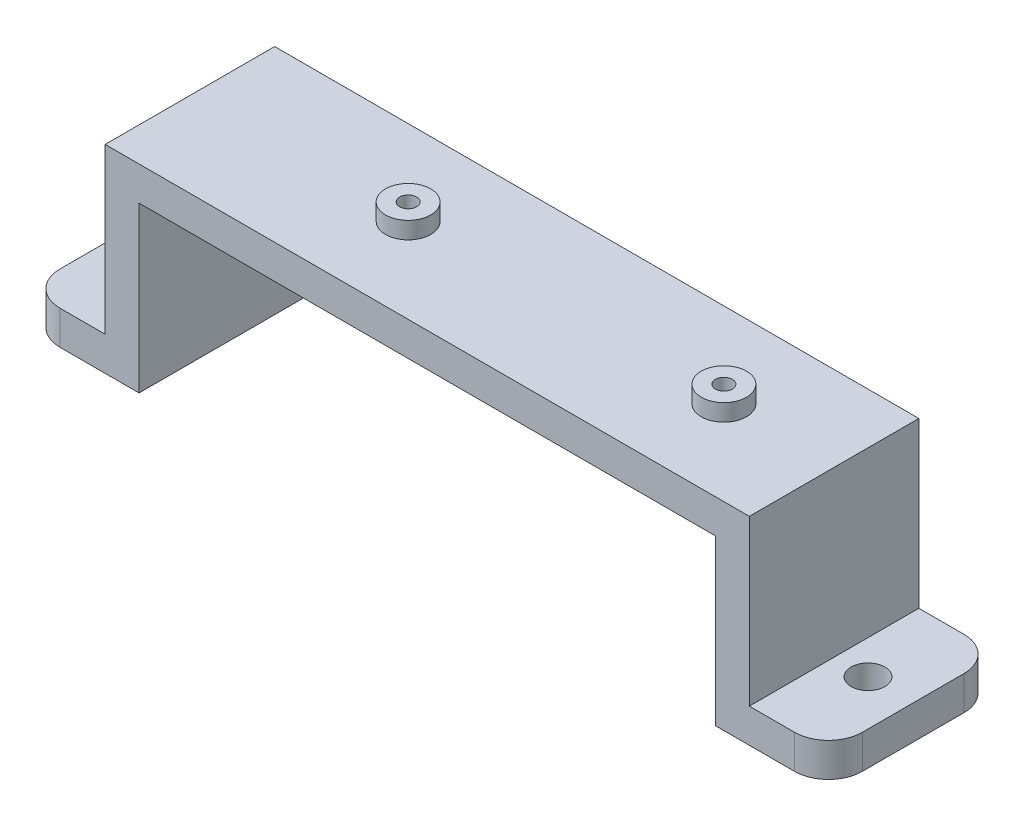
ISO-10303-21;
HEADER;
FILE_DESCRIPTION(('STEP AP214'),'2;1');
FILE_NAME('part.step','',(''),(''),'','','');
FILE_SCHEMA(('AUTOMOTIVE_DESIGN { 1 0 10303 214 1 1 1 1 }'));
ENDSEC;
DATA;
#1=APPLICATION_CONTEXT('core data for automotive mechanical design processes');
#2=APPLICATION_PROTOCOL_DEFINITION('international standard','automotive_design',2000,#1);
#3=PRODUCT_CONTEXT('',#1,'mechanical');
#4=PRODUCT('Part','Part','',(#3));
#5=PRODUCT_RELATED_PRODUCT_CATEGORY('part','',(#4));
#6=PRODUCT_DEFINITION_FORMATION('','',#4);
#7=PRODUCT_DEFINITION_CONTEXT('part definition',#1,'design');
#8=PRODUCT_DEFINITION('design','',#6,#7);
#9=PRODUCT_DEFINITION_SHAPE('','',#8);
#10=(LENGTH_UNIT() NAMED_UNIT(*) SI_UNIT(.MILLI.,.METRE.));
#11=(NAMED_UNIT(*) PLANE_ANGLE_UNIT() SI_UNIT($,.RADIAN.));
#12=(NAMED_UNIT(*) SI_UNIT($,.STERADIAN.) SOLID_ANGLE_UNIT());
#13=UNCERTAINTY_MEASURE_WITH_UNIT(LENGTH_MEASURE(1.E-05),#10,'distance_accuracy_value','');
#14=(GEOMETRIC_REPRESENTATION_CONTEXT(3) GLOBAL_UNCERTAINTY_ASSIGNED_CONTEXT((#13)) GLOBAL_UNIT_ASSIGNED_CONTEXT((#10,
#11,#12)) REPRESENTATION_CONTEXT('',''));
#15=CARTESIAN_POINT('',(0.,0.,0.));
#16=DIRECTION('',(0.,0.,1.));
#17=DIRECTION('',(1.,0.,0.));
#18=AXIS2_PLACEMENT_3D('',#15,#16,#17);
#19=CARTESIAN_POINT('',(-28.5,17.5476177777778,15.));
#20=DIRECTION('',(0.,-1.,0.));
#21=DIRECTION('',(0.,0.,-1.));
#22=AXIS2_PLACEMENT_3D('',#19,#20,#21);
#23=PLANE('',#22);
#24=CARTESIAN_POINT('',(18.75,17.5476177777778,7.5));
#25=DIRECTION('',(0.,-1.,0.));
#26=DIRECTION('',(0.,0.,-1.));
#27=AXIS2_PLACEMENT_3D('',#24,#25,#26);
#28=CIRCLE('',#27,2.);
#29=CARTESIAN_POINT('',(18.75,17.5476177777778,5.5));
#30=VERTEX_POINT('',#29);
#31=EDGE_CURVE('E34',#30,#30,#28,.F.);
#32=ORIENTED_EDGE('',*,*,#31,.F.);
#33=EDGE_LOOP('',(#32));
#34=FACE_BOUND('',#33,.T.);
#35=DIRECTION('',(-1.,0.,0.));
#36=VECTOR('',#35,1.);
#37=CARTESIAN_POINT('',(-28.5,17.5476177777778,0.));
#38=LINE('',#37,#36);
#39=CARTESIAN_POINT('',(28.5,17.5476177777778,0.));
#40=VERTEX_POINT('',#39);
#41=CARTESIAN_POINT('',(-28.5,17.5476177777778,0.));
#42=VERTEX_POINT('',#41);
#43=EDGE_CURVE('E181',#40,#42,#38,.T.);
#44=ORIENTED_EDGE('',*,*,#43,.T.);
#45=DIRECTION('',(0.,0.,-1.));
#46=VECTOR('',#45,1.);
#47=CARTESIAN_POINT('',(-28.5,17.5476177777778,15.));
#48=LINE('',#47,#46);
#49=CARTESIAN_POINT('',(-28.5,17.5476177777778,15.));
#50=VERTEX_POINT('',#49);
#51=EDGE_CURVE('E213',#50,#42,#48,.T.);
#52=ORIENTED_EDGE('',*,*,#51,.F.);
#53=DIRECTION('',(-1.,0.,0.));
#54=VECTOR('',#53,1.);
#55=CARTESIAN_POINT('',(-28.5,17.5476177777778,15.));
#56=LINE('',#55,#54);
#57=CARTESIAN_POINT('',(28.5,17.5476177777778,15.));
#58=VERTEX_POINT('',#57);
#59=EDGE_CURVE('E201',#58,#50,#56,.T.);
#60=ORIENTED_EDGE('',*,*,#59,.F.);
#61=DIRECTION('',(0.,0.,-1.));
#62=VECTOR('',#61,1.);
#63=CARTESIAN_POINT('',(28.5,17.5476177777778,15.));
#64=LINE('',#63,#62);
#65=EDGE_CURVE('E216',#58,#40,#64,.T.);
#66=ORIENTED_EDGE('',*,*,#65,.T.);
#67=EDGE_LOOP('',(#44,#52,#60,#66));
#68=FACE_BOUND('',#67,.T.);
#69=CARTESIAN_POINT('',(-9.19000000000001,17.5476177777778,7.5));
#70=DIRECTION('',(0.,-1.,0.));
#71=DIRECTION('',(0.,0.,-1.));
#72=AXIS2_PLACEMENT_3D('',#69,#70,#71);
#73=CIRCLE('',#72,2.);
#74=CARTESIAN_POINT('',(-9.19000000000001,17.5476177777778,5.5));
#75=VERTEX_POINT('',#74);
#76=EDGE_CURVE('E11',#75,#75,#73,.F.);
#77=ORIENTED_EDGE('',*,*,#76,.F.);
#78=EDGE_LOOP('',(#77));
#79=FACE_BOUND('',#78,.T.);
#80=ADVANCED_FACE('F26',(#34,#68,#79),#23,.F.);
#81=CARTESIAN_POINT('',(-35.5,0.,15.));
#82=DIRECTION('',(1.,0.,0.));
#83=DIRECTION('',(0.,0.,-1.));
#84=AXIS2_PLACEMENT_3D('',#81,#82,#83);
#85=PLANE('',#84);
#86=DIRECTION('',(0.,0.,-1.));
#87=VECTOR('',#86,1.);
#88=CARTESIAN_POINT('',(-35.5,0.,15.));
#89=LINE('',#88,#87);
#90=CARTESIAN_POINT('',(-35.5,0.,12.));
#91=VERTEX_POINT('',#90);
#92=CARTESIAN_POINT('',(-35.5,0.,3.));
#93=VERTEX_POINT('',#92);
#94=EDGE_CURVE('E160',#91,#93,#89,.T.);
#95=ORIENTED_EDGE('',*,*,#94,.F.);
#96=DIRECTION('',(0.,-1.,0.));
#97=VECTOR('',#96,1.);
#98=CARTESIAN_POINT('',(-35.5,0.,12.));
#99=LINE('',#98,#97);
#100=CARTESIAN_POINT('',(-35.5,3.,12.));
#101=VERTEX_POINT('',#100);
#102=EDGE_CURVE('E48',#91,#101,#99,.F.);
#103=ORIENTED_EDGE('',*,*,#102,.T.);
#104=DIRECTION('',(0.,0.,-1.));
#105=VECTOR('',#104,1.);
#106=CARTESIAN_POINT('',(-35.5,3.,15.));
#107=LINE('',#106,#105);
#108=CARTESIAN_POINT('',(-35.5,3.,3.));
#109=VERTEX_POINT('',#108);
#110=EDGE_CURVE('E208',#101,#109,#107,.T.);
#111=ORIENTED_EDGE('',*,*,#110,.T.);
#112=DIRECTION('',(0.,-1.,0.));
#113=VECTOR('',#112,1.);
#114=CARTESIAN_POINT('',(-35.5,0.,3.));
#115=LINE('',#114,#113);
#116=EDGE_CURVE('E262',#109,#93,#115,.T.);
#117=ORIENTED_EDGE('',*,*,#116,.T.);
#118=EDGE_LOOP('',(#95,#103,#111,#117));
#119=FACE_BOUND('',#118,.T.);
#120=ADVANCED_FACE('F28',(#119),#85,.F.);
#121=CARTESIAN_POINT('',(-35.5,0.,15.));
#122=DIRECTION('',(0.,1.,0.));
#123=DIRECTION('',(0.,0.,1.));
#124=AXIS2_PLACEMENT_3D('',#121,#122,#123);
#125=PLANE('',#124);
#126=CARTESIAN_POINT('',(-31.5,0.,7.5));
#127=DIRECTION('',(0.,-1.,0.));
#128=DIRECTION('',(-1.,0.,0.));
#129=AXIS2_PLACEMENT_3D('',#126,#127,#128);
#130=CIRCLE('',#129,1.5);
#131=CARTESIAN_POINT('',(-33.,0.,7.5));
#132=VERTEX_POINT('',#131);
#133=EDGE_CURVE('E276',#132,#132,#130,.T.);
#134=ORIENTED_EDGE('',*,*,#133,.F.);
#135=EDGE_LOOP('',(#134));
#136=FACE_BOUND('',#135,.T.);
#137=DIRECTION('',(1.,0.,0.));
#138=VECTOR('',#137,1.);
#139=CARTESIAN_POINT('',(-35.5,0.,15.));
#140=LINE('',#139,#138);
#141=CARTESIAN_POINT('',(-32.5,0.,15.));
#142=VERTEX_POINT('',#141);
#143=CARTESIAN_POINT('',(-25.5,0.,15.));
#144=VERTEX_POINT('',#143);
#145=EDGE_CURVE('E187',#142,#144,#140,.T.);
#146=ORIENTED_EDGE('',*,*,#145,.F.);
#147=CARTESIAN_POINT('',(-32.5,0.,12.));
#148=DIRECTION('',(0.,1.,0.));
#149=DIRECTION('',(0.,0.,1.));
#150=AXIS2_PLACEMENT_3D('',#147,#148,#149);
#151=CIRCLE('',#150,3.);
#152=EDGE_CURVE('E260',#142,#91,#151,.F.);
#153=ORIENTED_EDGE('',*,*,#152,.T.);
#154=ORIENTED_EDGE('',*,*,#94,.T.);
#155=CARTESIAN_POINT('',(-32.5,0.,3.));
#156=DIRECTION('',(0.,1.,0.));
#157=DIRECTION('',(0.,0.,1.));
#158=AXIS2_PLACEMENT_3D('',#155,#156,#157);
#159=CIRCLE('',#158,3.);
#160=CARTESIAN_POINT('',(-32.5,0.,0.));
#161=VERTEX_POINT('',#160);
#162=EDGE_CURVE('E148',#93,#161,#159,.F.);
#163=ORIENTED_EDGE('',*,*,#162,.T.);
#164=DIRECTION('',(1.,0.,0.));
#165=VECTOR('',#164,1.);
#166=CARTESIAN_POINT('',(-35.5,0.,0.));
#167=LINE('',#166,#165);
#168=CARTESIAN_POINT('',(-25.5,0.,0.));
#169=VERTEX_POINT('',#168);
#170=EDGE_CURVE('E141',#161,#169,#167,.T.);
#171=ORIENTED_EDGE('',*,*,#170,.T.);
#172=DIRECTION('',(0.,0.,-1.));
#173=VECTOR('',#172,1.);
#174=CARTESIAN_POINT('',(-25.5,0.,15.));
#175=LINE('',#174,#173);
#176=EDGE_CURVE('E145',#144,#169,#175,.T.);
#177=ORIENTED_EDGE('',*,*,#176,.F.);
#178=EDGE_LOOP('',(#146,#153,#154,#163,#171,#177));
#179=FACE_BOUND('',#178,.T.);
#180=ADVANCED_FACE('F144',(#136,#179),#125,.F.);
#181=CARTESIAN_POINT('',(-25.5,0.,15.));
#182=DIRECTION('',(-1.,0.,0.));
#183=DIRECTION('',(0.,0.,1.));
#184=AXIS2_PLACEMENT_3D('',#181,#182,#183);
#185=PLANE('',#184);
#186=DIRECTION('',(0.,1.,0.));
#187=VECTOR('',#186,1.);
#188=CARTESIAN_POINT('',(-25.5,0.,0.));
#189=LINE('',#188,#187);
#190=CARTESIAN_POINT('',(-25.5,14.5476177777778,0.));
#191=VERTEX_POINT('',#190);
#192=EDGE_CURVE('E152',#169,#191,#189,.T.);
#193=ORIENTED_EDGE('',*,*,#192,.T.);
#194=DIRECTION('',(0.,0.,-1.));
#195=VECTOR('',#194,1.);
#196=CARTESIAN_POINT('',(-25.5,14.5476177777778,15.));
#197=LINE('',#196,#195);
#198=CARTESIAN_POINT('',(-25.5,14.5476177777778,15.));
#199=VERTEX_POINT('',#198);
#200=EDGE_CURVE('E161',#199,#191,#197,.T.);
#201=ORIENTED_EDGE('',*,*,#200,.F.);
#202=DIRECTION('',(0.,1.,0.));
#203=VECTOR('',#202,1.);
#204=CARTESIAN_POINT('',(-25.5,0.,15.));
#205=LINE('',#204,#203);
#206=EDGE_CURVE('E159',#144,#199,#205,.T.);
#207=ORIENTED_EDGE('',*,*,#206,.F.);
#208=ORIENTED_EDGE('',*,*,#176,.T.);
#209=EDGE_LOOP('',(#193,#201,#207,#208));
#210=FACE_BOUND('',#209,.T.);
#211=ADVANCED_FACE('F156',(#210),#185,.F.);
#212=CARTESIAN_POINT('',(-25.5,14.5476177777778,15.));
#213=DIRECTION('',(0.,1.,0.));
#214=DIRECTION('',(-1.,0.,0.));
#215=AXIS2_PLACEMENT_3D('',#212,#213,#214);
#216=PLANE('',#215);
#217=CARTESIAN_POINT('',(18.75,14.5476177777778,7.5));
#218=DIRECTION('',(0.,1.,0.));
#219=DIRECTION('',(-1.,0.,0.));
#220=AXIS2_PLACEMENT_3D('',#217,#218,#219);
#221=CIRCLE('',#220,0.750000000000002);
#222=CARTESIAN_POINT('',(18.75,14.5476177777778,8.25));
#223=VERTEX_POINT('',#222);
#224=EDGE_CURVE('E272',#223,#223,#221,.T.);
#225=ORIENTED_EDGE('',*,*,#224,.T.);
#226=EDGE_LOOP('',(#225));
#227=FACE_BOUND('',#226,.T.);
#228=CARTESIAN_POINT('',(-9.19000000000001,14.5476177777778,7.5));
#229=DIRECTION('',(0.,1.,0.));
#230=DIRECTION('',(-1.,0.,0.));
#231=AXIS2_PLACEMENT_3D('',#228,#229,#230);
#232=CIRCLE('',#231,0.75);
#233=CARTESIAN_POINT('',(-9.19000000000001,14.5476177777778,8.25));
#234=VERTEX_POINT('',#233);
#235=EDGE_CURVE('E153',#234,#234,#232,.T.);
#236=ORIENTED_EDGE('',*,*,#235,.T.);
#237=EDGE_LOOP('',(#236));
#238=FACE_BOUND('',#237,.T.);
#239=DIRECTION('',(1.,0.,0.));
#240=VECTOR('',#239,1.);
#241=CARTESIAN_POINT('',(-25.5,14.5476177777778,0.));
#242=LINE('',#241,#240);
#243=CARTESIAN_POINT('',(25.5,14.5476177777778,0.));
#244=VERTEX_POINT('',#243);
#245=EDGE_CURVE('E167',#191,#244,#242,.T.);
#246=ORIENTED_EDGE('',*,*,#245,.T.);
#247=DIRECTION('',(0.,0.,-1.));
#248=VECTOR('',#247,1.);
#249=CARTESIAN_POINT('',(25.5,14.5476177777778,15.));
#250=LINE('',#249,#248);
#251=CARTESIAN_POINT('',(25.5,14.5476177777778,15.));
#252=VERTEX_POINT('',#251);
#253=EDGE_CURVE('E231',#252,#244,#250,.T.);
#254=ORIENTED_EDGE('',*,*,#253,.F.);
#255=DIRECTION('',(1.,0.,0.));
#256=VECTOR('',#255,1.);
#257=CARTESIAN_POINT('',(-25.5,14.5476177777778,15.));
#258=LINE('',#257,#256);
#259=EDGE_CURVE('E190',#199,#252,#258,.T.);
#260=ORIENTED_EDGE('',*,*,#259,.F.);
#261=ORIENTED_EDGE('',*,*,#200,.T.);
#262=EDGE_LOOP('',(#246,#254,#260,#261));
#263=FACE_BOUND('',#262,.T.);
#264=ADVANCED_FACE('F374',(#227,#238,#263),#216,.F.);
#265=CARTESIAN_POINT('',(25.5,14.5476177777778,15.));
#266=DIRECTION('',(1.,0.,0.));
#267=DIRECTION('',(0.,1.,0.));
#268=AXIS2_PLACEMENT_3D('',#265,#266,#267);
#269=PLANE('',#268);
#270=DIRECTION('',(0.,-1.,0.));
#271=VECTOR('',#270,1.);
#272=CARTESIAN_POINT('',(25.5,14.5476177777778,0.));
#273=LINE('',#272,#271);
#274=CARTESIAN_POINT('',(25.5,0.,0.));
#275=VERTEX_POINT('',#274);
#276=EDGE_CURVE('E169',#244,#275,#273,.T.);
#277=ORIENTED_EDGE('',*,*,#276,.T.);
#278=DIRECTION('',(0.,0.,-1.));
#279=VECTOR('',#278,1.);
#280=CARTESIAN_POINT('',(25.5,0.,15.));
#281=LINE('',#280,#279);
#282=CARTESIAN_POINT('',(25.5,0.,15.));
#283=VERTEX_POINT('',#282);
#284=EDGE_CURVE('E228',#283,#275,#281,.T.);
#285=ORIENTED_EDGE('',*,*,#284,.F.);
#286=DIRECTION('',(0.,-1.,0.));
#287=VECTOR('',#286,1.);
#288=CARTESIAN_POINT('',(25.5,14.5476177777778,15.));
#289=LINE('',#288,#287);
#290=EDGE_CURVE('E192',#252,#283,#289,.T.);
#291=ORIENTED_EDGE('',*,*,#290,.F.);
#292=ORIENTED_EDGE('',*,*,#253,.T.);
#293=EDGE_LOOP('',(#277,#285,#291,#292));
#294=FACE_BOUND('',#293,.T.);
#295=ADVANCED_FACE('F370',(#294),#269,.F.);
#296=CARTESIAN_POINT('',(25.5,0.,15.));
#297=DIRECTION('',(0.,1.,0.));
#298=DIRECTION('',(-1.,0.,0.));
#299=AXIS2_PLACEMENT_3D('',#296,#297,#298);
#300=PLANE('',#299);
#301=CARTESIAN_POINT('',(31.5,0.,7.5));
#302=DIRECTION('',(0.,-1.,0.));
#303=DIRECTION('',(1.,0.,0.));
#304=AXIS2_PLACEMENT_3D('',#301,#302,#303);
#305=CIRCLE('',#304,1.5);
#306=CARTESIAN_POINT('',(33.,0.,7.5));
#307=VERTEX_POINT('',#306);
#308=EDGE_CURVE('E273',#307,#307,#305,.T.);
#309=ORIENTED_EDGE('',*,*,#308,.F.);
#310=EDGE_LOOP('',(#309));
#311=FACE_BOUND('',#310,.T.);
#312=DIRECTION('',(0.,0.,-1.));
#313=VECTOR('',#312,1.);
#314=CARTESIAN_POINT('',(35.5,0.,15.));
#315=LINE('',#314,#313);
#316=CARTESIAN_POINT('',(35.5,0.,12.));
#317=VERTEX_POINT('',#316);
#318=CARTESIAN_POINT('',(35.5,0.,3.));
#319=VERTEX_POINT('',#318);
#320=EDGE_CURVE('E225',#317,#319,#315,.T.);
#321=ORIENTED_EDGE('',*,*,#320,.F.);
#322=CARTESIAN_POINT('',(32.5,0.,12.));
#323=DIRECTION('',(0.,1.,0.));
#324=DIRECTION('',(-1.,0.,0.));
#325=AXIS2_PLACEMENT_3D('',#322,#323,#324);
#326=CIRCLE('',#325,3.);
#327=CARTESIAN_POINT('',(32.5,0.,15.));
#328=VERTEX_POINT('',#327);
#329=EDGE_CURVE('E253',#317,#328,#326,.F.);
#330=ORIENTED_EDGE('',*,*,#329,.T.);
#331=DIRECTION('',(1.,0.,0.));
#332=VECTOR('',#331,1.);
#333=CARTESIAN_POINT('',(25.5,0.,15.));
#334=LINE('',#333,#332);
#335=EDGE_CURVE('E194',#283,#328,#334,.T.);
#336=ORIENTED_EDGE('',*,*,#335,.F.);
#337=ORIENTED_EDGE('',*,*,#284,.T.);
#338=DIRECTION('',(1.,0.,0.));
#339=VECTOR('',#338,1.);
#340=CARTESIAN_POINT('',(25.5,0.,0.));
#341=LINE('',#340,#339);
#342=CARTESIAN_POINT('',(32.5,0.,0.));
#343=VERTEX_POINT('',#342);
#344=EDGE_CURVE('E174',#275,#343,#341,.T.);
#345=ORIENTED_EDGE('',*,*,#344,.T.);
#346=CARTESIAN_POINT('',(32.5,0.,3.));
#347=DIRECTION('',(0.,1.,0.));
#348=DIRECTION('',(-1.,0.,0.));
#349=AXIS2_PLACEMENT_3D('',#346,#347,#348);
#350=CIRCLE('',#349,3.);
#351=EDGE_CURVE('E251',#343,#319,#350,.F.);
#352=ORIENTED_EDGE('',*,*,#351,.T.);
#353=EDGE_LOOP('',(#321,#330,#336,#337,#345,#352));
#354=FACE_BOUND('',#353,.T.);
#355=ADVANCED_FACE('F366',(#311,#354),#300,.F.);
#356=CARTESIAN_POINT('',(35.5,3.,15.));
#357=DIRECTION('',(-1.,0.,0.));
#358=DIRECTION('',(0.,0.,1.));
#359=AXIS2_PLACEMENT_3D('',#356,#357,#358);
#360=PLANE('',#359);
#361=DIRECTION('',(0.,0.,-1.));
#362=VECTOR('',#361,1.);
#363=CARTESIAN_POINT('',(35.5,3.,15.));
#364=LINE('',#363,#362);
#365=CARTESIAN_POINT('',(35.5,3.,12.));
#366=VERTEX_POINT('',#365);
#367=CARTESIAN_POINT('',(35.5,3.,3.));
#368=VERTEX_POINT('',#367);
#369=EDGE_CURVE('E222',#366,#368,#364,.T.);
#370=ORIENTED_EDGE('',*,*,#369,.F.);
#371=DIRECTION('',(0.,1.,0.));
#372=VECTOR('',#371,1.);
#373=CARTESIAN_POINT('',(35.5,3.,12.));
#374=LINE('',#373,#372);
#375=EDGE_CURVE('E249',#366,#317,#374,.F.);
#376=ORIENTED_EDGE('',*,*,#375,.T.);
#377=ORIENTED_EDGE('',*,*,#320,.T.);
#378=DIRECTION('',(0.,1.,0.));
#379=VECTOR('',#378,1.);
#380=CARTESIAN_POINT('',(35.5,3.,3.));
#381=LINE('',#380,#379);
#382=EDGE_CURVE('E246',#319,#368,#381,.T.);
#383=ORIENTED_EDGE('',*,*,#382,.T.);
#384=EDGE_LOOP('',(#370,#376,#377,#383));
#385=FACE_BOUND('',#384,.T.);
#386=ADVANCED_FACE('F362',(#385),#360,.F.);
#387=CARTESIAN_POINT('',(28.5,3.,15.));
#388=DIRECTION('',(0.,-1.,0.));
#389=DIRECTION('',(0.,0.,-1.));
#390=AXIS2_PLACEMENT_3D('',#387,#388,#389);
#391=PLANE('',#390);
#392=CARTESIAN_POINT('',(31.5,3.,7.5));
#393=DIRECTION('',(0.,-1.,0.));
#394=DIRECTION('',(0.,0.,-1.));
#395=AXIS2_PLACEMENT_3D('',#392,#393,#394);
#396=CIRCLE('',#395,1.5);
#397=CARTESIAN_POINT('',(31.5,3.,5.99999999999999));
#398=VERTEX_POINT('',#397);
#399=EDGE_CURVE('E269',#398,#398,#396,.T.);
#400=ORIENTED_EDGE('',*,*,#399,.T.);
#401=EDGE_LOOP('',(#400));
#402=FACE_BOUND('',#401,.T.);
#403=DIRECTION('',(-1.,0.,0.));
#404=VECTOR('',#403,1.);
#405=CARTESIAN_POINT('',(28.5,3.,15.));
#406=LINE('',#405,#404);
#407=CARTESIAN_POINT('',(32.5,3.,15.));
#408=VERTEX_POINT('',#407);
#409=CARTESIAN_POINT('',(28.5,3.,15.));
#410=VERTEX_POINT('',#409);
#411=EDGE_CURVE('E197',#408,#410,#406,.T.);
#412=ORIENTED_EDGE('',*,*,#411,.F.);
#413=CARTESIAN_POINT('',(32.5,3.,12.));
#414=DIRECTION('',(0.,-1.,0.));
#415=DIRECTION('',(0.,0.,-1.));
#416=AXIS2_PLACEMENT_3D('',#413,#414,#415);
#417=CIRCLE('',#416,3.);
#418=EDGE_CURVE('E244',#408,#366,#417,.F.);
#419=ORIENTED_EDGE('',*,*,#418,.T.);
#420=ORIENTED_EDGE('',*,*,#369,.T.);
#421=CARTESIAN_POINT('',(32.5,3.,3.));
#422=DIRECTION('',(0.,-1.,0.));
#423=DIRECTION('',(0.,0.,-1.));
#424=AXIS2_PLACEMENT_3D('',#421,#422,#423);
#425=CIRCLE('',#424,3.);
#426=CARTESIAN_POINT('',(32.5,3.,0.));
#427=VERTEX_POINT('',#426);
#428=EDGE_CURVE('E242',#368,#427,#425,.F.);
#429=ORIENTED_EDGE('',*,*,#428,.T.);
#430=DIRECTION('',(-1.,0.,0.));
#431=VECTOR('',#430,1.);
#432=CARTESIAN_POINT('',(28.5,3.,0.));
#433=LINE('',#432,#431);
#434=CARTESIAN_POINT('',(28.5,3.,0.));
#435=VERTEX_POINT('',#434);
#436=EDGE_CURVE('E177',#427,#435,#433,.T.);
#437=ORIENTED_EDGE('',*,*,#436,.T.);
#438=DIRECTION('',(0.,0.,-1.));
#439=VECTOR('',#438,1.);
#440=CARTESIAN_POINT('',(28.5,3.,15.));
#441=LINE('',#440,#439);
#442=EDGE_CURVE('E219',#410,#435,#441,.T.);
#443=ORIENTED_EDGE('',*,*,#442,.F.);
#444=EDGE_LOOP('',(#412,#419,#420,#429,#437,#443));
#445=FACE_BOUND('',#444,.T.);
#446=ADVANCED_FACE('F358',(#402,#445),#391,.F.);
#447=CARTESIAN_POINT('',(28.5,17.5476177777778,15.));
#448=DIRECTION('',(-1.,0.,0.));
#449=DIRECTION('',(0.,-1.,0.));
#450=AXIS2_PLACEMENT_3D('',#447,#448,#449);
#451=PLANE('',#450);
#452=DIRECTION('',(0.,1.,0.));
#453=VECTOR('',#452,1.);
#454=CARTESIAN_POINT('',(28.5,17.5476177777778,0.));
#455=LINE('',#454,#453);
#456=EDGE_CURVE('E179',#435,#40,#455,.T.);
#457=ORIENTED_EDGE('',*,*,#456,.T.);
#458=ORIENTED_EDGE('',*,*,#65,.F.);
#459=DIRECTION('',(0.,1.,0.));
#460=VECTOR('',#459,1.);
#461=CARTESIAN_POINT('',(28.5,17.5476177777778,15.));
#462=LINE('',#461,#460);
#463=EDGE_CURVE('E199',#410,#58,#462,.T.);
#464=ORIENTED_EDGE('',*,*,#463,.F.);
#465=ORIENTED_EDGE('',*,*,#442,.T.);
#466=EDGE_LOOP('',(#457,#458,#464,#465));
#467=FACE_BOUND('',#466,.T.);
#468=ADVANCED_FACE('F353',(#467),#451,.F.);
#469=CARTESIAN_POINT('',(-28.5,3.,15.));
#470=DIRECTION('',(1.,0.,0.));
#471=DIRECTION('',(0.,0.,-1.));
#472=AXIS2_PLACEMENT_3D('',#469,#470,#471);
#473=PLANE('',#472);
#474=DIRECTION('',(0.,-1.,0.));
#475=VECTOR('',#474,1.);
#476=CARTESIAN_POINT('',(-28.5,3.,0.));
#477=LINE('',#476,#475);
#478=CARTESIAN_POINT('',(-28.5,3.,0.));
#479=VERTEX_POINT('',#478);
#480=EDGE_CURVE('E183',#42,#479,#477,.T.);
#481=ORIENTED_EDGE('',*,*,#480,.T.);
#482=DIRECTION('',(0.,0.,-1.));
#483=VECTOR('',#482,1.);
#484=CARTESIAN_POINT('',(-28.5,3.,15.));
#485=LINE('',#484,#483);
#486=CARTESIAN_POINT('',(-28.5,3.,15.));
#487=VERTEX_POINT('',#486);
#488=EDGE_CURVE('E210',#487,#479,#485,.T.);
#489=ORIENTED_EDGE('',*,*,#488,.F.);
#490=DIRECTION('',(0.,-1.,0.));
#491=VECTOR('',#490,1.);
#492=CARTESIAN_POINT('',(-28.5,3.,15.));
#493=LINE('',#492,#491);
#494=EDGE_CURVE('E203',#50,#487,#493,.T.);
#495=ORIENTED_EDGE('',*,*,#494,.F.);
#496=ORIENTED_EDGE('',*,*,#51,.T.);
#497=EDGE_LOOP('',(#481,#489,#495,#496));
#498=FACE_BOUND('',#497,.T.);
#499=ADVANCED_FACE('F350',(#498),#473,.F.);
#500=CARTESIAN_POINT('',(-35.5,3.,15.));
#501=DIRECTION('',(0.,-1.,0.));
#502=DIRECTION('',(0.,0.,-1.));
#503=AXIS2_PLACEMENT_3D('',#500,#501,#502);
#504=PLANE('',#503);
#505=CARTESIAN_POINT('',(-31.5,3.,7.5));
#506=DIRECTION('',(0.,-1.,0.));
#507=DIRECTION('',(0.,0.,-1.));
#508=AXIS2_PLACEMENT_3D('',#505,#506,#507);
#509=CIRCLE('',#508,1.5);
#510=CARTESIAN_POINT('',(-31.5,3.,5.99999999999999));
#511=VERTEX_POINT('',#510);
#512=EDGE_CURVE('E274',#511,#511,#509,.T.);
#513=ORIENTED_EDGE('',*,*,#512,.T.);
#514=EDGE_LOOP('',(#513));
#515=FACE_BOUND('',#514,.T.);
#516=ORIENTED_EDGE('',*,*,#110,.F.);
#517=CARTESIAN_POINT('',(-32.5,3.,12.));
#518=DIRECTION('',(0.,-1.,0.));
#519=DIRECTION('',(0.,0.,-1.));
#520=AXIS2_PLACEMENT_3D('',#517,#518,#519);
#521=CIRCLE('',#520,3.);
#522=CARTESIAN_POINT('',(-32.5,3.,15.));
#523=VERTEX_POINT('',#522);
#524=EDGE_CURVE('E267',#101,#523,#521,.F.);
#525=ORIENTED_EDGE('',*,*,#524,.T.);
#526=DIRECTION('',(-1.,0.,0.));
#527=VECTOR('',#526,1.);
#528=CARTESIAN_POINT('',(-35.5,3.,15.));
#529=LINE('',#528,#527);
#530=EDGE_CURVE('E205',#487,#523,#529,.T.);
#531=ORIENTED_EDGE('',*,*,#530,.F.);
#532=ORIENTED_EDGE('',*,*,#488,.T.);
#533=DIRECTION('',(-1.,0.,0.));
#534=VECTOR('',#533,1.);
#535=CARTESIAN_POINT('',(-35.5,3.,0.));
#536=LINE('',#535,#534);
#537=CARTESIAN_POINT('',(-32.5,3.,0.));
#538=VERTEX_POINT('',#537);
#539=EDGE_CURVE('E185',#479,#538,#536,.T.);
#540=ORIENTED_EDGE('',*,*,#539,.T.);
#541=CARTESIAN_POINT('',(-32.5,3.,3.));
#542=DIRECTION('',(0.,-1.,0.));
#543=DIRECTION('',(0.,0.,-1.));
#544=AXIS2_PLACEMENT_3D('',#541,#542,#543);
#545=CIRCLE('',#544,3.);
#546=EDGE_CURVE('E41',#538,#109,#545,.F.);
#547=ORIENTED_EDGE('',*,*,#546,.T.);
#548=EDGE_LOOP('',(#516,#525,#531,#532,#540,#547));
#549=FACE_BOUND('',#548,.T.);
#550=ADVANCED_FACE('F346',(#515,#549),#504,.F.);
#551=CARTESIAN_POINT('',(-35.5,3.,15.));
#552=DIRECTION('',(0.,0.,-1.));
#553=DIRECTION('',(-1.,0.,0.));
#554=AXIS2_PLACEMENT_3D('',#551,#552,#553);
#555=PLANE('',#554);
#556=ORIENTED_EDGE('',*,*,#335,.T.);
#557=DIRECTION('',(0.,1.,0.));
#558=VECTOR('',#557,1.);
#559=CARTESIAN_POINT('',(32.5,3.,15.));
#560=LINE('',#559,#558);
#561=EDGE_CURVE('E239',#328,#408,#560,.T.);
#562=ORIENTED_EDGE('',*,*,#561,.T.);
#563=ORIENTED_EDGE('',*,*,#411,.T.);
#564=ORIENTED_EDGE('',*,*,#463,.T.);
#565=ORIENTED_EDGE('',*,*,#59,.T.);
#566=ORIENTED_EDGE('',*,*,#494,.T.);
#567=ORIENTED_EDGE('',*,*,#530,.T.);
#568=DIRECTION('',(0.,-1.,0.));
#569=VECTOR('',#568,1.);
#570=CARTESIAN_POINT('',(-32.5,3.,15.));
#571=LINE('',#570,#569);
#572=EDGE_CURVE('E236',#523,#142,#571,.T.);
#573=ORIENTED_EDGE('',*,*,#572,.T.);
#574=ORIENTED_EDGE('',*,*,#145,.T.);
#575=ORIENTED_EDGE('',*,*,#206,.T.);
#576=ORIENTED_EDGE('',*,*,#259,.T.);
#577=ORIENTED_EDGE('',*,*,#290,.T.);
#578=EDGE_LOOP('',(#556,#562,#563,#564,#565,#566,#567,#573,#574,#575,#576,#577));
#579=FACE_BOUND('',#578,.T.);
#580=ADVANCED_FACE('F343',(#579),#555,.F.);
#581=CARTESIAN_POINT('',(-35.5,3.,0.));
#582=DIRECTION('',(0.,0.,-1.));
#583=DIRECTION('',(-1.,0.,0.));
#584=AXIS2_PLACEMENT_3D('',#581,#582,#583);
#585=PLANE('',#584);
#586=ORIENTED_EDGE('',*,*,#436,.F.);
#587=DIRECTION('',(0.,1.,0.));
#588=VECTOR('',#587,1.);
#589=CARTESIAN_POINT('',(32.5,0.,0.));
#590=LINE('',#589,#588);
#591=EDGE_CURVE('E257',#427,#343,#590,.F.);
#592=ORIENTED_EDGE('',*,*,#591,.T.);
#593=ORIENTED_EDGE('',*,*,#344,.F.);
#594=ORIENTED_EDGE('',*,*,#276,.F.);
#595=ORIENTED_EDGE('',*,*,#245,.F.);
#596=ORIENTED_EDGE('',*,*,#192,.F.);
#597=ORIENTED_EDGE('',*,*,#170,.F.);
#598=DIRECTION('',(0.,-1.,0.));
#599=VECTOR('',#598,1.);
#600=CARTESIAN_POINT('',(-32.5,3.,0.));
#601=LINE('',#600,#599);
#602=EDGE_CURVE('E255',#161,#538,#601,.F.);
#603=ORIENTED_EDGE('',*,*,#602,.T.);
#604=ORIENTED_EDGE('',*,*,#539,.F.);
#605=ORIENTED_EDGE('',*,*,#480,.F.);
#606=ORIENTED_EDGE('',*,*,#43,.F.);
#607=ORIENTED_EDGE('',*,*,#456,.F.);
#608=EDGE_LOOP('',(#586,#592,#593,#594,#595,#596,#597,#603,#604,#605,#606,#607));
#609=FACE_BOUND('',#608,.T.);
#610=ADVANCED_FACE('F165',(#609),#585,.T.);
#611=CARTESIAN_POINT('',(-9.19000000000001,0.,7.5));
#612=DIRECTION('',(0.,1.,0.));
#613=DIRECTION('',(0.,0.,1.));
#614=AXIS2_PLACEMENT_3D('',#611,#612,#613);
#615=CYLINDRICAL_SURFACE('',#614,0.75);
#616=CARTESIAN_POINT('',(-9.19000000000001,19.0476177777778,7.5));
#617=DIRECTION('',(0.,1.,0.));
#618=DIRECTION('',(0.,0.,1.));
#619=AXIS2_PLACEMENT_3D('',#616,#617,#618);
#620=CIRCLE('',#619,0.75);
#621=CARTESIAN_POINT('',(-9.19000000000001,19.0476177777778,8.25));
#622=VERTEX_POINT('',#621);
#623=EDGE_CURVE('E404',#622,#622,#620,.T.);
#624=CARTESIAN_POINT('',(-9.19000000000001,14.5476177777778,8.25));
#625=CARTESIAN_POINT('',(-9.19000000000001,14.5944927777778,8.25));
#626=CARTESIAN_POINT('',(-9.19000000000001,14.6413677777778,8.25));
#627=CARTESIAN_POINT('',(-9.19000000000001,14.7351177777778,8.25));
#628=CARTESIAN_POINT('',(-9.19000000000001,14.7819927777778,8.25));
#629=CARTESIAN_POINT('',(-9.19000000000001,14.8757427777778,8.25));
#630=CARTESIAN_POINT('',(-9.19000000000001,14.9226177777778,8.25));
#631=CARTESIAN_POINT('',(-9.19000000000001,15.0163677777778,8.25));
#632=CARTESIAN_POINT('',(-9.19000000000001,15.0632427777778,8.25));
#633=CARTESIAN_POINT('',(-9.19000000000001,15.1569927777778,8.25));
#634=CARTESIAN_POINT('',(-9.19000000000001,15.2038677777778,8.25));
#635=CARTESIAN_POINT('',(-9.19000000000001,15.2976177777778,8.25));
#636=CARTESIAN_POINT('',(-9.19000000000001,15.3444927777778,8.25));
#637=CARTESIAN_POINT('',(-9.19000000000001,15.4382427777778,8.25));
#638=CARTESIAN_POINT('',(-9.19000000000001,15.4851177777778,8.25));
#639=CARTESIAN_POINT('',(-9.19000000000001,15.5788677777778,8.25));
#640=CARTESIAN_POINT('',(-9.19000000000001,15.6257427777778,8.25));
#641=CARTESIAN_POINT('',(-9.19000000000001,15.7194927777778,8.25));
#642=CARTESIAN_POINT('',(-9.19000000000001,15.7663677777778,8.25));
#643=CARTESIAN_POINT('',(-9.19000000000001,15.8601177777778,8.25));
#644=CARTESIAN_POINT('',(-9.19000000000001,15.9069927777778,8.25));
#645=CARTESIAN_POINT('',(-9.19000000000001,16.0007427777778,8.25));
#646=CARTESIAN_POINT('',(-9.19000000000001,16.0476177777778,8.25));
#647=CARTESIAN_POINT('',(-9.19000000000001,16.1413677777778,8.25));
#648=CARTESIAN_POINT('',(-9.19000000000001,16.1882427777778,8.25));
#649=CARTESIAN_POINT('',(-9.19000000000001,16.2819927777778,8.25));
#650=CARTESIAN_POINT('',(-9.19000000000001,16.3288677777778,8.25));
#651=CARTESIAN_POINT('',(-9.19000000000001,16.4226177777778,8.25));
#652=CARTESIAN_POINT('',(-9.19000000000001,16.4694927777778,8.25));
#653=CARTESIAN_POINT('',(-9.19000000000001,16.5632427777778,8.25));
#654=CARTESIAN_POINT('',(-9.19000000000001,16.6101177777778,8.25));
#655=CARTESIAN_POINT('',(-9.19000000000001,16.7038677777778,8.25));
#656=CARTESIAN_POINT('',(-9.19000000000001,16.7507427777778,8.25));
#657=CARTESIAN_POINT('',(-9.19000000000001,16.8444927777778,8.25));
#658=CARTESIAN_POINT('',(-9.19000000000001,16.8913677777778,8.25));
#659=CARTESIAN_POINT('',(-9.19000000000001,16.9851177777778,8.25));
#660=CARTESIAN_POINT('',(-9.19000000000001,17.0319927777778,8.25));
#661=CARTESIAN_POINT('',(-9.19000000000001,17.1257427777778,8.25));
#662=CARTESIAN_POINT('',(-9.19000000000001,17.1726177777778,8.25));
#663=CARTESIAN_POINT('',(-9.19000000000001,17.2663677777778,8.25));
#664=CARTESIAN_POINT('',(-9.19000000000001,17.3132427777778,8.25));
#665=CARTESIAN_POINT('',(-9.19000000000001,17.4069927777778,8.25));
#666=CARTESIAN_POINT('',(-9.19000000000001,17.4538677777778,8.25));
#667=CARTESIAN_POINT('',(-9.19000000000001,17.5476177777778,8.25));
#668=CARTESIAN_POINT('',(-9.19000000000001,17.5944927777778,8.25));
#669=CARTESIAN_POINT('',(-9.19000000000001,17.6882427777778,8.25));
#670=CARTESIAN_POINT('',(-9.19000000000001,17.7351177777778,8.25));
#671=CARTESIAN_POINT('',(-9.19000000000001,17.8288677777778,8.25));
#672=CARTESIAN_POINT('',(-9.19000000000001,17.8757427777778,8.25));
#673=CARTESIAN_POINT('',(-9.19000000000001,17.9694927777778,8.25));
#674=CARTESIAN_POINT('',(-9.19000000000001,18.0163677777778,8.25));
#675=CARTESIAN_POINT('',(-9.19000000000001,18.1101177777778,8.25));
#676=CARTESIAN_POINT('',(-9.19000000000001,18.1569927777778,8.25));
#677=CARTESIAN_POINT('',(-9.19000000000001,18.2507427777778,8.25));
#678=CARTESIAN_POINT('',(-9.19000000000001,18.2976177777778,8.25));
#679=CARTESIAN_POINT('',(-9.19000000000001,18.3913677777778,8.25));
#680=CARTESIAN_POINT('',(-9.19000000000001,18.4382427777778,8.25));
#681=CARTESIAN_POINT('',(-9.19000000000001,18.5319927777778,8.25));
#682=CARTESIAN_POINT('',(-9.19000000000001,18.5788677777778,8.25));
#683=CARTESIAN_POINT('',(-9.19000000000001,18.6726177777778,8.25));
#684=CARTESIAN_POINT('',(-9.19000000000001,18.7194927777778,8.25));
#685=CARTESIAN_POINT('',(-9.19000000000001,18.8132427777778,8.25));
#686=CARTESIAN_POINT('',(-9.19000000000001,18.8601177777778,8.25));
#687=CARTESIAN_POINT('',(-9.19000000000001,18.9538677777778,8.25));
#688=CARTESIAN_POINT('',(-9.19000000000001,19.0007427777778,8.25));
#689=CARTESIAN_POINT('',(-9.19000000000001,19.0476177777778,8.25));
#690=B_SPLINE_CURVE_WITH_KNOTS('',3,(#624,#625,#626,#627,#628,#629,#630,#631,#632,#633,#634,
#635,#636,#637,#638,#639,#640,#641,#642,#643,#644,#645,#646,#647,#648,#649,#650,#651,#652,#653,
#654,#655,#656,#657,#658,#659,#660,#661,#662,#663,#664,#665,#666,#667,#668,#669,#670,#671,#672,
#673,#674,#675,#676,#677,#678,#679,#680,#681,#682,#683,#684,#685,#686,#687,#688,#689),
.UNSPECIFIED.,.F.,.F.,(4,2,2,2,2,2,2,2,2,2,2,2,2,2,2,2,2,2,2,2,2,2,2,2,2,2,2,2,2,2,2,2,4),(0.,
0.140625,0.28125,0.421875,0.5625,0.703125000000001,0.843750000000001,0.984375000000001,1.125,
1.265625,1.40625,1.546875,1.6875,1.828125,1.96875,2.109375,2.25,2.390625,2.53125,2.671875,
2.8125,2.953125,3.09375,3.234375,3.375,3.515625,3.65625,3.796875,3.9375,4.078125,4.21875,
4.359375,4.5),.UNSPECIFIED.);
#691=EDGE_CURVE('BSEAM336',#234,#622,#690,.T.);
#692=ORIENTED_EDGE('',*,*,#235,.F.);
#693=ORIENTED_EDGE('',*,*,#623,.T.);
#694=ORIENTED_EDGE('',*,*,#691,.T.);
#695=ORIENTED_EDGE('',*,*,#691,.F.);
#696=EDGE_LOOP('',(#692,#694,#693,#695));
#697=FACE_BOUND('',#696,.T.);
#698=ADVANCED_FACE('F336',(#697),#615,.F.);
#699=CARTESIAN_POINT('',(18.75,0.,7.5));
#700=DIRECTION('',(0.,1.,0.));
#701=DIRECTION('',(0.,0.,1.));
#702=AXIS2_PLACEMENT_3D('',#699,#700,#701);
#703=CYLINDRICAL_SURFACE('',#702,0.750000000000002);
#704=CARTESIAN_POINT('',(18.75,19.0476177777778,7.5));
#705=DIRECTION('',(0.,1.,0.));
#706=DIRECTION('',(0.,0.,1.));
#707=AXIS2_PLACEMENT_3D('',#704,#705,#706);
#708=CIRCLE('',#707,0.750000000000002);
#709=CARTESIAN_POINT('',(18.75,19.0476177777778,8.25));
#710=VERTEX_POINT('',#709);
#711=EDGE_CURVE('E390',#710,#710,#708,.T.);
#712=CARTESIAN_POINT('',(18.75,14.5476177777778,8.25));
#713=CARTESIAN_POINT('',(18.75,14.5944927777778,8.25));
#714=CARTESIAN_POINT('',(18.75,14.6413677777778,8.25));
#715=CARTESIAN_POINT('',(18.75,14.7351177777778,8.25));
#716=CARTESIAN_POINT('',(18.75,14.7819927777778,8.25));
#717=CARTESIAN_POINT('',(18.75,14.8757427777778,8.25));
#718=CARTESIAN_POINT('',(18.75,14.9226177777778,8.25));
#719=CARTESIAN_POINT('',(18.75,15.0163677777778,8.25));
#720=CARTESIAN_POINT('',(18.75,15.0632427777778,8.25));
#721=CARTESIAN_POINT('',(18.75,15.1569927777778,8.25));
#722=CARTESIAN_POINT('',(18.75,15.2038677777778,8.25));
#723=CARTESIAN_POINT('',(18.75,15.2976177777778,8.25));
#724=CARTESIAN_POINT('',(18.75,15.3444927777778,8.25));
#725=CARTESIAN_POINT('',(18.75,15.4382427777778,8.25));
#726=CARTESIAN_POINT('',(18.75,15.4851177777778,8.25));
#727=CARTESIAN_POINT('',(18.75,15.5788677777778,8.25));
#728=CARTESIAN_POINT('',(18.75,15.6257427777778,8.25));
#729=CARTESIAN_POINT('',(18.75,15.7194927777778,8.25));
#730=CARTESIAN_POINT('',(18.75,15.7663677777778,8.25));
#731=CARTESIAN_POINT('',(18.75,15.8601177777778,8.25));
#732=CARTESIAN_POINT('',(18.75,15.9069927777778,8.25));
#733=CARTESIAN_POINT('',(18.75,16.0007427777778,8.25));
#734=CARTESIAN_POINT('',(18.75,16.0476177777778,8.25));
#735=CARTESIAN_POINT('',(18.75,16.1413677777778,8.25));
#736=CARTESIAN_POINT('',(18.75,16.1882427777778,8.25));
#737=CARTESIAN_POINT('',(18.75,16.2819927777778,8.25));
#738=CARTESIAN_POINT('',(18.75,16.3288677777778,8.25));
#739=CARTESIAN_POINT('',(18.75,16.4226177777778,8.25));
#740=CARTESIAN_POINT('',(18.75,16.4694927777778,8.25));
#741=CARTESIAN_POINT('',(18.75,16.5632427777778,8.25));
#742=CARTESIAN_POINT('',(18.75,16.6101177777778,8.25));
#743=CARTESIAN_POINT('',(18.75,16.7038677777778,8.25));
#744=CARTESIAN_POINT('',(18.75,16.7507427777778,8.25));
#745=CARTESIAN_POINT('',(18.75,16.8444927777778,8.25));
#746=CARTESIAN_POINT('',(18.75,16.8913677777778,8.25));
#747=CARTESIAN_POINT('',(18.75,16.9851177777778,8.25));
#748=CARTESIAN_POINT('',(18.75,17.0319927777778,8.25));
#749=CARTESIAN_POINT('',(18.75,17.1257427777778,8.25));
#750=CARTESIAN_POINT('',(18.75,17.1726177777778,8.25));
#751=CARTESIAN_POINT('',(18.75,17.2663677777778,8.25));
#752=CARTESIAN_POINT('',(18.75,17.3132427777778,8.25));
#753=CARTESIAN_POINT('',(18.75,17.4069927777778,8.25));
#754=CARTESIAN_POINT('',(18.75,17.4538677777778,8.25));
#755=CARTESIAN_POINT('',(18.75,17.5476177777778,8.25));
#756=CARTESIAN_POINT('',(18.75,17.5944927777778,8.25));
#757=CARTESIAN_POINT('',(18.75,17.6882427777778,8.25));
#758=CARTESIAN_POINT('',(18.75,17.7351177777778,8.25));
#759=CARTESIAN_POINT('',(18.75,17.8288677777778,8.25));
#760=CARTESIAN_POINT('',(18.75,17.8757427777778,8.25));
#761=CARTESIAN_POINT('',(18.75,17.9694927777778,8.25));
#762=CARTESIAN_POINT('',(18.75,18.0163677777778,8.25));
#763=CARTESIAN_POINT('',(18.75,18.1101177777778,8.25));
#764=CARTESIAN_POINT('',(18.75,18.1569927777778,8.25));
#765=CARTESIAN_POINT('',(18.75,18.2507427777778,8.25));
#766=CARTESIAN_POINT('',(18.75,18.2976177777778,8.25));
#767=CARTESIAN_POINT('',(18.75,18.3913677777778,8.25));
#768=CARTESIAN_POINT('',(18.75,18.4382427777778,8.25));
#769=CARTESIAN_POINT('',(18.75,18.5319927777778,8.25));
#770=CARTESIAN_POINT('',(18.75,18.5788677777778,8.25));
#771=CARTESIAN_POINT('',(18.75,18.6726177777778,8.25));
#772=CARTESIAN_POINT('',(18.75,18.7194927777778,8.25));
#773=CARTESIAN_POINT('',(18.75,18.8132427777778,8.25));
#774=CARTESIAN_POINT('',(18.75,18.8601177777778,8.25));
#775=CARTESIAN_POINT('',(18.75,18.9538677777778,8.25));
#776=CARTESIAN_POINT('',(18.75,19.0007427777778,8.25));
#777=CARTESIAN_POINT('',(18.75,19.0476177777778,8.25));
#778=B_SPLINE_CURVE_WITH_KNOTS('',3,(#712,#713,#714,#715,#716,#717,#718,#719,#720,#721,#722,
#723,#724,#725,#726,#727,#728,#729,#730,#731,#732,#733,#734,#735,#736,#737,#738,#739,#740,#741,
#742,#743,#744,#745,#746,#747,#748,#749,#750,#751,#752,#753,#754,#755,#756,#757,#758,#759,#760,
#761,#762,#763,#764,#765,#766,#767,#768,#769,#770,#771,#772,#773,#774,#775,#776,#777),
.UNSPECIFIED.,.F.,.F.,(4,2,2,2,2,2,2,2,2,2,2,2,2,2,2,2,2,2,2,2,2,2,2,2,2,2,2,2,2,2,2,2,4),(0.,
0.140625,0.28125,0.421875,0.5625,0.703125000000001,0.843750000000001,0.984374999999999,1.125,
1.265625,1.40625,1.546875,1.6875,1.828125,1.96875,2.109375,2.25,2.390625,2.53125,2.671875,
2.8125,2.953125,3.09375,3.234375,3.375,3.515625,3.65625,3.796875,3.9375,4.078125,4.21875,
4.359375,4.5),.UNSPECIFIED.);
#779=EDGE_CURVE('BSEAM332',#223,#710,#778,.T.);
#780=ORIENTED_EDGE('',*,*,#224,.F.);
#781=ORIENTED_EDGE('',*,*,#711,.T.);
#782=ORIENTED_EDGE('',*,*,#779,.T.);
#783=ORIENTED_EDGE('',*,*,#779,.F.);
#784=EDGE_LOOP('',(#780,#782,#781,#783));
#785=FACE_BOUND('',#784,.T.);
#786=ADVANCED_FACE('F332',(#785),#703,.F.);
#787=CARTESIAN_POINT('',(32.5,3.,12.));
#788=DIRECTION('',(0.,1.,0.));
#789=DIRECTION('',(0.,0.,1.));
#790=AXIS2_PLACEMENT_3D('',#787,#788,#789);
#791=CYLINDRICAL_SURFACE('',#790,3.);
#792=ORIENTED_EDGE('',*,*,#329,.F.);
#793=ORIENTED_EDGE('',*,*,#375,.F.);
#794=ORIENTED_EDGE('',*,*,#418,.F.);
#795=ORIENTED_EDGE('',*,*,#561,.F.);
#796=EDGE_LOOP('',(#792,#793,#794,#795));
#797=FACE_BOUND('',#796,.T.);
#798=ADVANCED_FACE('F328',(#797),#791,.T.);
#799=CARTESIAN_POINT('',(32.5,3.,3.));
#800=DIRECTION('',(0.,-1.,0.));
#801=DIRECTION('',(0.,0.,-1.));
#802=AXIS2_PLACEMENT_3D('',#799,#800,#801);
#803=CYLINDRICAL_SURFACE('',#802,3.);
#804=ORIENTED_EDGE('',*,*,#351,.F.);
#805=ORIENTED_EDGE('',*,*,#591,.F.);
#806=ORIENTED_EDGE('',*,*,#428,.F.);
#807=ORIENTED_EDGE('',*,*,#382,.F.);
#808=EDGE_LOOP('',(#804,#805,#806,#807));
#809=FACE_BOUND('',#808,.T.);
#810=ADVANCED_FACE('F324',(#809),#803,.T.);
#811=CARTESIAN_POINT('',(-32.5,3.,12.));
#812=DIRECTION('',(0.,-1.,0.));
#813=DIRECTION('',(0.,0.,-1.));
#814=AXIS2_PLACEMENT_3D('',#811,#812,#813);
#815=CYLINDRICAL_SURFACE('',#814,3.);
#816=ORIENTED_EDGE('',*,*,#524,.F.);
#817=ORIENTED_EDGE('',*,*,#102,.F.);
#818=ORIENTED_EDGE('',*,*,#152,.F.);
#819=ORIENTED_EDGE('',*,*,#572,.F.);
#820=EDGE_LOOP('',(#816,#817,#818,#819));
#821=FACE_BOUND('',#820,.T.);
#822=ADVANCED_FACE('F320',(#821),#815,.T.);
#823=CARTESIAN_POINT('',(-32.5,0.,3.));
#824=DIRECTION('',(0.,1.,0.));
#825=DIRECTION('',(0.,0.,1.));
#826=AXIS2_PLACEMENT_3D('',#823,#824,#825);
#827=CYLINDRICAL_SURFACE('',#826,3.);
#828=ORIENTED_EDGE('',*,*,#546,.F.);
#829=ORIENTED_EDGE('',*,*,#602,.F.);
#830=ORIENTED_EDGE('',*,*,#162,.F.);
#831=ORIENTED_EDGE('',*,*,#116,.F.);
#832=EDGE_LOOP('',(#828,#829,#830,#831));
#833=FACE_BOUND('',#832,.T.);
#834=ADVANCED_FACE('F316',(#833),#827,.T.);
#835=CARTESIAN_POINT('',(31.5,17.5476177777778,7.5));
#836=DIRECTION('',(0.,-1.,0.));
#837=DIRECTION('',(1.,0.,0.));
#838=AXIS2_PLACEMENT_3D('',#835,#836,#837);
#839=CYLINDRICAL_SURFACE('',#838,1.5);
#840=ORIENTED_EDGE('',*,*,#308,.T.);
#841=EDGE_LOOP('',(#840));
#842=FACE_BOUND('',#841,.T.);
#843=ORIENTED_EDGE('',*,*,#399,.F.);
#844=EDGE_LOOP('',(#843));
#845=FACE_BOUND('',#844,.T.);
#846=ADVANCED_FACE('F312',(#842,#845),#839,.F.);
#847=CARTESIAN_POINT('',(-31.5,17.5476177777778,7.5));
#848=DIRECTION('',(0.,-1.,0.));
#849=DIRECTION('',(1.,0.,0.));
#850=AXIS2_PLACEMENT_3D('',#847,#848,#849);
#851=CYLINDRICAL_SURFACE('',#850,1.5);
#852=ORIENTED_EDGE('',*,*,#133,.T.);
#853=EDGE_LOOP('',(#852));
#854=FACE_BOUND('',#853,.T.);
#855=ORIENTED_EDGE('',*,*,#512,.F.);
#856=EDGE_LOOP('',(#855));
#857=FACE_BOUND('',#856,.T.);
#858=ADVANCED_FACE('F305',(#854,#857),#851,.F.);
#859=CARTESIAN_POINT('',(18.75,19.0476177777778,7.5));
#860=DIRECTION('',(0.,1.,0.));
#861=DIRECTION('',(0.,0.,1.));
#862=AXIS2_PLACEMENT_3D('',#859,#860,#861);
#863=PLANE('',#862);
#864=CARTESIAN_POINT('',(18.75,19.0476177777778,7.5));
#865=DIRECTION('',(0.,1.,0.));
#866=DIRECTION('',(0.,0.,1.));
#867=AXIS2_PLACEMENT_3D('',#864,#865,#866);
#868=CIRCLE('',#867,2.);
#869=CARTESIAN_POINT('',(18.75,19.0476177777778,9.5));
#870=VERTEX_POINT('',#869);
#871=EDGE_CURVE('E387',#870,#870,#868,.T.);
#872=ORIENTED_EDGE('',*,*,#871,.T.);
#873=EDGE_LOOP('',(#872));
#874=FACE_BOUND('',#873,.T.);
#875=ORIENTED_EDGE('',*,*,#711,.F.);
#876=EDGE_LOOP('',(#875));
#877=FACE_BOUND('',#876,.T.);
#878=ADVANCED_FACE('F302',(#874,#877),#863,.T.);
#879=CARTESIAN_POINT('',(18.75,19.0476177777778,7.5));
#880=DIRECTION('',(0.,-1.,0.));
#881=DIRECTION('',(0.,0.,-1.));
#882=AXIS2_PLACEMENT_3D('',#879,#880,#881);
#883=CYLINDRICAL_SURFACE('',#882,2.);
#884=ORIENTED_EDGE('',*,*,#871,.F.);
#885=EDGE_LOOP('',(#884));
#886=FACE_BOUND('',#885,.T.);
#887=ORIENTED_EDGE('',*,*,#31,.T.);
#888=EDGE_LOOP('',(#887));
#889=FACE_BOUND('',#888,.T.);
#890=ADVANCED_FACE('F280',(#886,#889),#883,.T.);
#891=CARTESIAN_POINT('',(-9.19000000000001,19.0476177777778,7.5));
#892=DIRECTION('',(0.,1.,0.));
#893=DIRECTION('',(0.,0.,1.));
#894=AXIS2_PLACEMENT_3D('',#891,#892,#893);
#895=PLANE('',#894);
#896=CARTESIAN_POINT('',(-9.19000000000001,19.0476177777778,7.5));
#897=DIRECTION('',(0.,1.,0.));
#898=DIRECTION('',(0.,0.,1.));
#899=AXIS2_PLACEMENT_3D('',#896,#897,#898);
#900=CIRCLE('',#899,2.);
#901=CARTESIAN_POINT('',(-9.19000000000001,19.0476177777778,9.5));
#902=VERTEX_POINT('',#901);
#903=EDGE_CURVE('E406',#902,#902,#900,.T.);
#904=ORIENTED_EDGE('',*,*,#903,.T.);
#905=EDGE_LOOP('',(#904));
#906=FACE_BOUND('',#905,.T.);
#907=ORIENTED_EDGE('',*,*,#623,.F.);
#908=EDGE_LOOP('',(#907));
#909=FACE_BOUND('',#908,.T.);
#910=ADVANCED_FACE('F292',(#906,#909),#895,.T.);
#911=CARTESIAN_POINT('',(-9.19000000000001,19.0476177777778,7.5));
#912=DIRECTION('',(0.,-1.,0.));
#913=DIRECTION('',(0.,0.,-1.));
#914=AXIS2_PLACEMENT_3D('',#911,#912,#913);
#915=CYLINDRICAL_SURFACE('',#914,2.);
#916=ORIENTED_EDGE('',*,*,#903,.F.);
#917=EDGE_LOOP('',(#916));
#918=FACE_BOUND('',#917,.T.);
#919=ORIENTED_EDGE('',*,*,#76,.T.);
#920=EDGE_LOOP('',(#919));
#921=FACE_BOUND('',#920,.T.);
#922=ADVANCED_FACE('F290',(#918,#921),#915,.T.);
#923=CLOSED_SHELL('',(#80,#120,#180,#211,#264,#295,#355,#386,#446,#468,#499,#550,#580,#610,#698,
#786,#798,#810,#822,#834,#846,#858,#878,#890,#910,#922));
#924=MANIFOLD_SOLID_BREP('B2',#923);
#925=ADVANCED_BREP_SHAPE_REPRESENTATION('',(#18,#924),#14);
#926=SHAPE_DEFINITION_REPRESENTATION(#9,#925);
ENDSEC;
END-ISO-10303-21;
